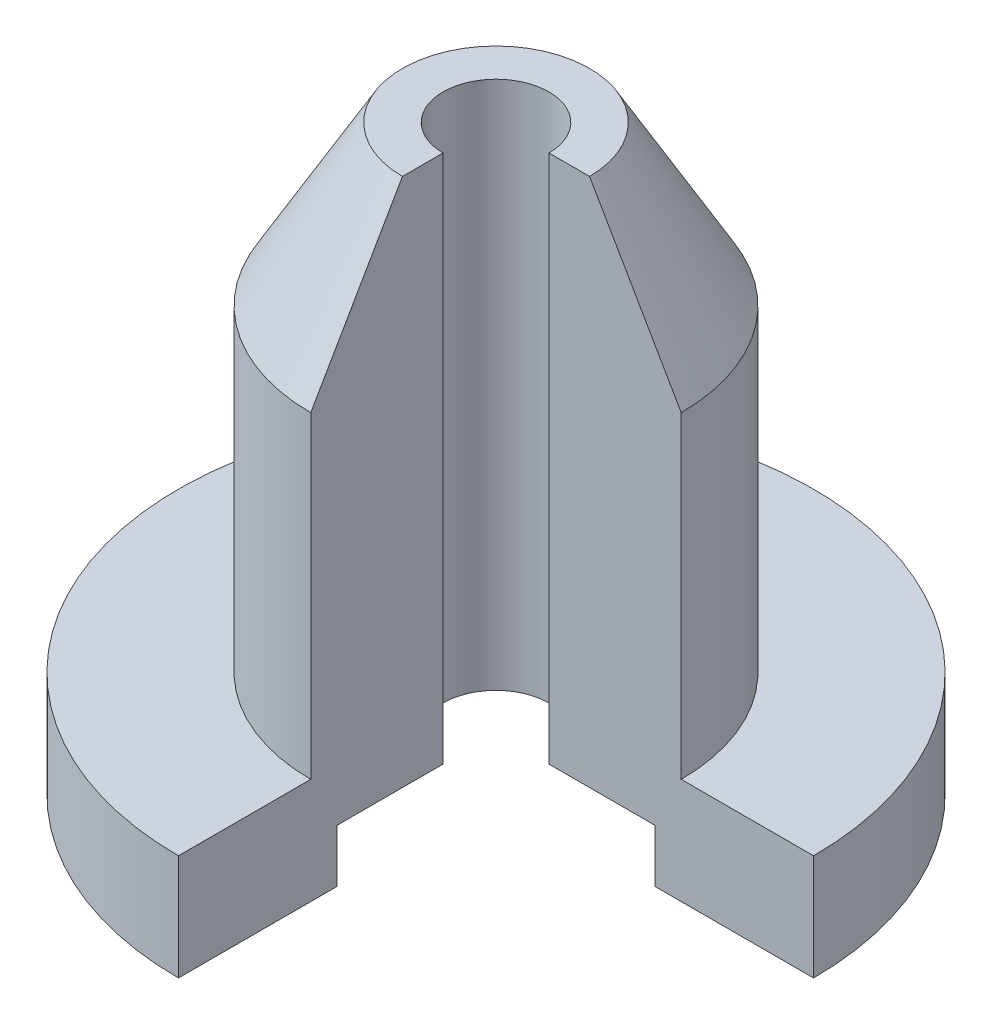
ISO-10303-21;
HEADER;
FILE_DESCRIPTION(('STEP AP214'),'2;1');
FILE_NAME('part.step','',(''),(''),'','','');
FILE_SCHEMA(('AUTOMOTIVE_DESIGN { 1 0 10303 214 1 1 1 1 }'));
ENDSEC;
DATA;
#1=APPLICATION_CONTEXT('core data for automotive mechanical design processes');
#2=APPLICATION_PROTOCOL_DEFINITION('international standard','automotive_design',2000,#1);
#3=PRODUCT_CONTEXT('',#1,'mechanical');
#4=PRODUCT('Part','Part','',(#3));
#5=PRODUCT_RELATED_PRODUCT_CATEGORY('part','',(#4));
#6=PRODUCT_DEFINITION_FORMATION('','',#4);
#7=PRODUCT_DEFINITION_CONTEXT('part definition',#1,'design');
#8=PRODUCT_DEFINITION('design','',#6,#7);
#9=PRODUCT_DEFINITION_SHAPE('','',#8);
#10=(LENGTH_UNIT() NAMED_UNIT(*) SI_UNIT(.MILLI.,.METRE.));
#11=(NAMED_UNIT(*) PLANE_ANGLE_UNIT() SI_UNIT($,.RADIAN.));
#12=(NAMED_UNIT(*) SI_UNIT($,.STERADIAN.) SOLID_ANGLE_UNIT());
#13=UNCERTAINTY_MEASURE_WITH_UNIT(LENGTH_MEASURE(1.E-05),#10,'distance_accuracy_value','');
#14=(GEOMETRIC_REPRESENTATION_CONTEXT(3) GLOBAL_UNCERTAINTY_ASSIGNED_CONTEXT((#13)) GLOBAL_UNIT_ASSIGNED_CONTEXT((#10,
#11,#12)) REPRESENTATION_CONTEXT('',''));
#15=CARTESIAN_POINT('',(0.,0.,0.));
#16=DIRECTION('',(0.,0.,1.));
#17=DIRECTION('',(1.,0.,0.));
#18=AXIS2_PLACEMENT_3D('',#15,#16,#17);
#19=CARTESIAN_POINT('',(3.14233320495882E-13,0.,30.));
#20=DIRECTION('',(0.,-1.,0.));
#21=DIRECTION('',(0.,0.,-1.));
#22=AXIS2_PLACEMENT_3D('',#19,#20,#21);
#23=PLANE('',#22);
#24=CARTESIAN_POINT('',(0.,0.,0.));
#25=DIRECTION('',(0.,-1.,0.));
#26=DIRECTION('',(0.,0.,-1.));
#27=AXIS2_PLACEMENT_3D('',#24,#25,#26);
#28=CIRCLE('',#27,15.);
#29=CARTESIAN_POINT('',(1.57116660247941E-13,0.,15.));
#30=VERTEX_POINT('',#29);
#31=CARTESIAN_POINT('',(15.,0.,0.));
#32=VERTEX_POINT('',#31);
#33=EDGE_CURVE('E11',#30,#32,#28,.T.);
#34=ORIENTED_EDGE('',*,*,#33,.F.);
#35=DIRECTION('',(0.,0.,1.));
#36=VECTOR('',#35,1.);
#37=CARTESIAN_POINT('',(3.14233320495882E-13,0.,30.));
#38=LINE('',#37,#36);
#39=CARTESIAN_POINT('',(3.14233320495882E-13,0.,30.));
#40=VERTEX_POINT('',#39);
#41=EDGE_CURVE('E105',#30,#40,#38,.T.);
#42=ORIENTED_EDGE('',*,*,#41,.T.);
#43=CARTESIAN_POINT('',(0.,0.,0.));
#44=DIRECTION('',(0.,-1.,0.));
#45=DIRECTION('',(0.,0.,-1.));
#46=AXIS2_PLACEMENT_3D('',#43,#44,#45);
#47=CIRCLE('',#46,30.);
#48=CARTESIAN_POINT('',(30.,0.,0.));
#49=VERTEX_POINT('',#48);
#50=EDGE_CURVE('E100',#40,#49,#47,.T.);
#51=ORIENTED_EDGE('',*,*,#50,.T.);
#52=DIRECTION('',(1.,0.,0.));
#53=VECTOR('',#52,1.);
#54=CARTESIAN_POINT('',(30.,0.,0.));
#55=LINE('',#54,#53);
#56=EDGE_CURVE('E103',#32,#49,#55,.T.);
#57=ORIENTED_EDGE('',*,*,#56,.F.);
#58=EDGE_LOOP('',(#34,#42,#51,#57));
#59=FACE_BOUND('',#58,.T.);
#60=ADVANCED_FACE('F34',(#59),#23,.T.);
#61=CARTESIAN_POINT('',(0.,0.,0.));
#62=DIRECTION('',(0.,-1.,0.));
#63=DIRECTION('',(0.,0.,-1.));
#64=AXIS2_PLACEMENT_3D('',#61,#62,#63);
#65=CYLINDRICAL_SURFACE('',#64,15.);
#66=CARTESIAN_POINT('',(0.,5.,0.));
#67=DIRECTION('',(0.,-1.,0.));
#68=DIRECTION('',(0.,0.,-1.));
#69=AXIS2_PLACEMENT_3D('',#66,#67,#68);
#70=CIRCLE('',#69,15.);
#71=CARTESIAN_POINT('',(1.57116660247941E-13,5.,15.));
#72=VERTEX_POINT('',#71);
#73=CARTESIAN_POINT('',(15.,5.,0.));
#74=VERTEX_POINT('',#73);
#75=EDGE_CURVE('E42',#72,#74,#70,.T.);
#76=ORIENTED_EDGE('',*,*,#75,.F.);
#77=DIRECTION('',(0.,-1.,0.));
#78=VECTOR('',#77,1.);
#79=CARTESIAN_POINT('',(1.57116660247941E-13,0.,15.));
#80=LINE('',#79,#78);
#81=EDGE_CURVE('E110',#72,#30,#80,.T.);
#82=ORIENTED_EDGE('',*,*,#81,.T.);
#83=ORIENTED_EDGE('',*,*,#33,.T.);
#84=DIRECTION('',(0.,-1.,0.));
#85=VECTOR('',#84,1.);
#86=CARTESIAN_POINT('',(15.,0.,0.));
#87=LINE('',#86,#85);
#88=EDGE_CURVE('E123',#74,#32,#87,.T.);
#89=ORIENTED_EDGE('',*,*,#88,.F.);
#90=EDGE_LOOP('',(#76,#82,#83,#89));
#91=FACE_BOUND('',#90,.T.);
#92=ADVANCED_FACE('F36',(#91),#65,.F.);
#93=CARTESIAN_POINT('',(1.57116660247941E-13,5.,15.));
#94=DIRECTION('',(0.,-1.,0.));
#95=DIRECTION('',(0.,0.,-1.));
#96=AXIS2_PLACEMENT_3D('',#93,#94,#95);
#97=PLANE('',#96);
#98=CARTESIAN_POINT('',(0.,5.,0.));
#99=DIRECTION('',(0.,-1.,0.));
#100=DIRECTION('',(0.,0.,-1.));
#101=AXIS2_PLACEMENT_3D('',#98,#99,#100);
#102=CIRCLE('',#101,5.);
#103=CARTESIAN_POINT('',(0.,5.,5.));
#104=VERTEX_POINT('',#103);
#105=CARTESIAN_POINT('',(5.,5.,0.));
#106=VERTEX_POINT('',#105);
#107=EDGE_CURVE('E172',#104,#106,#102,.T.);
#108=ORIENTED_EDGE('',*,*,#107,.F.);
#109=DIRECTION('',(0.,0.,1.));
#110=VECTOR('',#109,1.);
#111=CARTESIAN_POINT('',(1.57116660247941E-13,5.,15.));
#112=LINE('',#111,#110);
#113=EDGE_CURVE('E160',#104,#72,#112,.T.);
#114=ORIENTED_EDGE('',*,*,#113,.T.);
#115=ORIENTED_EDGE('',*,*,#75,.T.);
#116=DIRECTION('',(1.,0.,0.));
#117=VECTOR('',#116,1.);
#118=CARTESIAN_POINT('',(15.,5.,0.));
#119=LINE('',#118,#117);
#120=EDGE_CURVE('E139',#106,#74,#119,.T.);
#121=ORIENTED_EDGE('',*,*,#120,.F.);
#122=EDGE_LOOP('',(#108,#114,#115,#121));
#123=FACE_BOUND('',#122,.T.);
#124=ADVANCED_FACE('F175',(#123),#97,.T.);
#125=CARTESIAN_POINT('',(0.,0.,0.));
#126=DIRECTION('',(0.,-1.,0.));
#127=DIRECTION('',(0.,0.,-1.));
#128=AXIS2_PLACEMENT_3D('',#125,#126,#127);
#129=CYLINDRICAL_SURFACE('',#128,5.);
#130=CARTESIAN_POINT('',(0.,55.,0.));
#131=DIRECTION('',(0.,-1.,0.));
#132=DIRECTION('',(0.,0.,-1.));
#133=AXIS2_PLACEMENT_3D('',#130,#131,#132);
#134=CIRCLE('',#133,5.);
#135=CARTESIAN_POINT('',(0.,55.,5.));
#136=VERTEX_POINT('',#135);
#137=CARTESIAN_POINT('',(5.,55.,0.));
#138=VERTEX_POINT('',#137);
#139=EDGE_CURVE('E170',#136,#138,#134,.T.);
#140=ORIENTED_EDGE('',*,*,#139,.F.);
#141=DIRECTION('',(0.,-1.,0.));
#142=VECTOR('',#141,1.);
#143=CARTESIAN_POINT('',(0.,5.,5.));
#144=LINE('',#143,#142);
#145=EDGE_CURVE('E157',#136,#104,#144,.T.);
#146=ORIENTED_EDGE('',*,*,#145,.T.);
#147=ORIENTED_EDGE('',*,*,#107,.T.);
#148=DIRECTION('',(0.,-1.,0.));
#149=VECTOR('',#148,1.);
#150=CARTESIAN_POINT('',(5.,5.,0.));
#151=LINE('',#150,#149);
#152=EDGE_CURVE('E136',#138,#106,#151,.T.);
#153=ORIENTED_EDGE('',*,*,#152,.F.);
#154=EDGE_LOOP('',(#140,#146,#147,#153));
#155=FACE_BOUND('',#154,.T.);
#156=ADVANCED_FACE('F198',(#155),#129,.F.);
#157=CARTESIAN_POINT('',(0.,55.,5.));
#158=DIRECTION('',(0.,1.,0.));
#159=DIRECTION('',(0.,0.,1.));
#160=AXIS2_PLACEMENT_3D('',#157,#158,#159);
#161=PLANE('',#160);
#162=CARTESIAN_POINT('',(0.,55.,0.));
#163=DIRECTION('',(0.,-1.,0.));
#164=DIRECTION('',(0.,0.,-1.));
#165=AXIS2_PLACEMENT_3D('',#162,#163,#164);
#166=CIRCLE('',#165,8.83974596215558);
#167=CARTESIAN_POINT('',(0.,55.,8.83974596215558));
#168=VERTEX_POINT('',#167);
#169=CARTESIAN_POINT('',(8.83974596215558,55.,0.));
#170=VERTEX_POINT('',#169);
#171=EDGE_CURVE('E168',#168,#170,#166,.T.);
#172=ORIENTED_EDGE('',*,*,#171,.F.);
#173=DIRECTION('',(0.,0.,-1.));
#174=VECTOR('',#173,1.);
#175=CARTESIAN_POINT('',(0.,55.,5.));
#176=LINE('',#175,#174);
#177=EDGE_CURVE('E154',#168,#136,#176,.T.);
#178=ORIENTED_EDGE('',*,*,#177,.T.);
#179=ORIENTED_EDGE('',*,*,#139,.T.);
#180=DIRECTION('',(-1.,0.,0.));
#181=VECTOR('',#180,1.);
#182=CARTESIAN_POINT('',(5.,55.,0.));
#183=LINE('',#182,#181);
#184=EDGE_CURVE('E133',#170,#138,#183,.T.);
#185=ORIENTED_EDGE('',*,*,#184,.F.);
#186=EDGE_LOOP('',(#172,#178,#179,#185));
#187=FACE_BOUND('',#186,.T.);
#188=ADVANCED_FACE('F195',(#187),#161,.T.);
#189=CARTESIAN_POINT('',(0.,40.,0.));
#190=DIRECTION('',(0.,-1.,0.));
#191=DIRECTION('',(0.,0.,-1.));
#192=AXIS2_PLACEMENT_3D('',#189,#190,#191);
#193=CONICAL_SURFACE('',#192,17.5,0.5235987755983);
#194=CARTESIAN_POINT('',(0.,40.,0.));
#195=DIRECTION('',(0.,-1.,0.));
#196=DIRECTION('',(0.,0.,-1.));
#197=AXIS2_PLACEMENT_3D('',#194,#195,#196);
#198=CIRCLE('',#197,17.5);
#199=CARTESIAN_POINT('',(1.83302770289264E-13,40.,17.5));
#200=VERTEX_POINT('',#199);
#201=CARTESIAN_POINT('',(17.5,40.,0.));
#202=VERTEX_POINT('',#201);
#203=EDGE_CURVE('E166',#200,#202,#198,.T.);
#204=ORIENTED_EDGE('',*,*,#203,.F.);
#205=DIRECTION('',(0.,0.866025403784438,-0.500000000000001));
#206=VECTOR('',#205,1.);
#207=CARTESIAN_POINT('',(0.,55.,8.83974596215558));
#208=LINE('',#207,#206);
#209=EDGE_CURVE('E151',#200,#168,#208,.T.);
#210=ORIENTED_EDGE('',*,*,#209,.T.);
#211=ORIENTED_EDGE('',*,*,#171,.T.);
#212=DIRECTION('',(-0.500000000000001,0.866025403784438,0.));
#213=VECTOR('',#212,1.);
#214=CARTESIAN_POINT('',(8.83974596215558,55.,0.));
#215=LINE('',#214,#213);
#216=EDGE_CURVE('E130',#202,#170,#215,.T.);
#217=ORIENTED_EDGE('',*,*,#216,.F.);
#218=EDGE_LOOP('',(#204,#210,#211,#217));
#219=FACE_BOUND('',#218,.T.);
#220=ADVANCED_FACE('F191',(#219),#193,.T.);
#221=CARTESIAN_POINT('',(0.,0.,0.));
#222=DIRECTION('',(0.,-1.,0.));
#223=DIRECTION('',(0.,0.,-1.));
#224=AXIS2_PLACEMENT_3D('',#221,#222,#223);
#225=CYLINDRICAL_SURFACE('',#224,17.5);
#226=CARTESIAN_POINT('',(0.,10.,0.));
#227=DIRECTION('',(0.,-1.,0.));
#228=DIRECTION('',(0.,0.,-1.));
#229=AXIS2_PLACEMENT_3D('',#226,#227,#228);
#230=CIRCLE('',#229,17.5);
#231=CARTESIAN_POINT('',(1.83302770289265E-13,10.,17.5));
#232=VERTEX_POINT('',#231);
#233=CARTESIAN_POINT('',(17.5,10.,0.));
#234=VERTEX_POINT('',#233);
#235=EDGE_CURVE('E164',#232,#234,#230,.T.);
#236=ORIENTED_EDGE('',*,*,#235,.F.);
#237=DIRECTION('',(0.,1.,0.));
#238=VECTOR('',#237,1.);
#239=CARTESIAN_POINT('',(1.83302770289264E-13,40.,17.5));
#240=LINE('',#239,#238);
#241=EDGE_CURVE('E148',#232,#200,#240,.T.);
#242=ORIENTED_EDGE('',*,*,#241,.T.);
#243=ORIENTED_EDGE('',*,*,#203,.T.);
#244=DIRECTION('',(0.,1.,0.));
#245=VECTOR('',#244,1.);
#246=CARTESIAN_POINT('',(17.5,40.,0.));
#247=LINE('',#246,#245);
#248=EDGE_CURVE('E127',#234,#202,#247,.T.);
#249=ORIENTED_EDGE('',*,*,#248,.F.);
#250=EDGE_LOOP('',(#236,#242,#243,#249));
#251=FACE_BOUND('',#250,.T.);
#252=ADVANCED_FACE('F189',(#251),#225,.T.);
#253=CARTESIAN_POINT('',(1.83302770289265E-13,10.,17.5));
#254=DIRECTION('',(0.,1.,0.));
#255=DIRECTION('',(0.,0.,1.));
#256=AXIS2_PLACEMENT_3D('',#253,#254,#255);
#257=PLANE('',#256);
#258=CARTESIAN_POINT('',(0.,10.,0.));
#259=DIRECTION('',(0.,-1.,0.));
#260=DIRECTION('',(0.,0.,-1.));
#261=AXIS2_PLACEMENT_3D('',#258,#259,#260);
#262=CIRCLE('',#261,30.);
#263=CARTESIAN_POINT('',(3.14233320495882E-13,10.,30.));
#264=VERTEX_POINT('',#263);
#265=CARTESIAN_POINT('',(30.,10.,0.));
#266=VERTEX_POINT('',#265);
#267=EDGE_CURVE('E109',#264,#266,#262,.T.);
#268=ORIENTED_EDGE('',*,*,#267,.F.);
#269=DIRECTION('',(0.,0.,-1.));
#270=VECTOR('',#269,1.);
#271=CARTESIAN_POINT('',(1.83302770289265E-13,10.,17.5));
#272=LINE('',#271,#270);
#273=EDGE_CURVE('E145',#264,#232,#272,.T.);
#274=ORIENTED_EDGE('',*,*,#273,.T.);
#275=ORIENTED_EDGE('',*,*,#235,.T.);
#276=DIRECTION('',(-1.,0.,0.));
#277=VECTOR('',#276,1.);
#278=CARTESIAN_POINT('',(17.5,10.,0.));
#279=LINE('',#278,#277);
#280=EDGE_CURVE('E118',#266,#234,#279,.T.);
#281=ORIENTED_EDGE('',*,*,#280,.F.);
#282=EDGE_LOOP('',(#268,#274,#275,#281));
#283=FACE_BOUND('',#282,.T.);
#284=ADVANCED_FACE('F185',(#283),#257,.T.);
#285=CARTESIAN_POINT('',(0.,0.,0.));
#286=DIRECTION('',(0.,-1.,0.));
#287=DIRECTION('',(0.,0.,-1.));
#288=AXIS2_PLACEMENT_3D('',#285,#286,#287);
#289=CYLINDRICAL_SURFACE('',#288,30.);
#290=DIRECTION('',(0.,1.,0.));
#291=VECTOR('',#290,1.);
#292=CARTESIAN_POINT('',(3.14233320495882E-13,10.,30.));
#293=LINE('',#292,#291);
#294=EDGE_CURVE('E143',#40,#264,#293,.T.);
#295=ORIENTED_EDGE('',*,*,#294,.T.);
#296=ORIENTED_EDGE('',*,*,#267,.T.);
#297=DIRECTION('',(0.,1.,0.));
#298=VECTOR('',#297,1.);
#299=CARTESIAN_POINT('',(30.,10.,0.));
#300=LINE('',#299,#298);
#301=EDGE_CURVE('E113',#49,#266,#300,.T.);
#302=ORIENTED_EDGE('',*,*,#301,.F.);
#303=ORIENTED_EDGE('',*,*,#50,.F.);
#304=EDGE_LOOP('',(#295,#296,#302,#303));
#305=FACE_BOUND('',#304,.T.);
#306=ADVANCED_FACE('F114',(#305),#289,.T.);
#307=CARTESIAN_POINT('',(0.,0.,0.));
#308=DIRECTION('',(1.,0.,0.));
#309=DIRECTION('',(0.,0.,-1.));
#310=AXIS2_PLACEMENT_3D('',#307,#308,#309);
#311=PLANE('',#310);
#312=ORIENTED_EDGE('',*,*,#41,.F.);
#313=ORIENTED_EDGE('',*,*,#81,.F.);
#314=ORIENTED_EDGE('',*,*,#113,.F.);
#315=ORIENTED_EDGE('',*,*,#145,.F.);
#316=ORIENTED_EDGE('',*,*,#177,.F.);
#317=ORIENTED_EDGE('',*,*,#209,.F.);
#318=ORIENTED_EDGE('',*,*,#241,.F.);
#319=ORIENTED_EDGE('',*,*,#273,.F.);
#320=ORIENTED_EDGE('',*,*,#294,.F.);
#321=EDGE_LOOP('',(#312,#313,#314,#315,#316,#317,#318,#319,#320));
#322=FACE_BOUND('',#321,.T.);
#323=ADVANCED_FACE('F180',(#322),#311,.T.);
#324=CARTESIAN_POINT('',(0.,0.,0.));
#325=DIRECTION('',(0.,0.,-1.));
#326=DIRECTION('',(-1.,0.,0.));
#327=AXIS2_PLACEMENT_3D('',#324,#325,#326);
#328=PLANE('',#327);
#329=ORIENTED_EDGE('',*,*,#56,.T.);
#330=ORIENTED_EDGE('',*,*,#301,.T.);
#331=ORIENTED_EDGE('',*,*,#280,.T.);
#332=ORIENTED_EDGE('',*,*,#248,.T.);
#333=ORIENTED_EDGE('',*,*,#216,.T.);
#334=ORIENTED_EDGE('',*,*,#184,.T.);
#335=ORIENTED_EDGE('',*,*,#152,.T.);
#336=ORIENTED_EDGE('',*,*,#120,.T.);
#337=ORIENTED_EDGE('',*,*,#88,.T.);
#338=EDGE_LOOP('',(#329,#330,#331,#332,#333,#334,#335,#336,#337));
#339=FACE_BOUND('',#338,.T.);
#340=ADVANCED_FACE('F121',(#339),#328,.F.);
#341=CLOSED_SHELL('',(#60,#92,#124,#156,#188,#220,#252,#284,#306,#323,#340));
#342=MANIFOLD_SOLID_BREP('B2',#341);
#343=ADVANCED_BREP_SHAPE_REPRESENTATION('',(#18,#342),#14);
#344=SHAPE_DEFINITION_REPRESENTATION(#9,#343);
ENDSEC;
END-ISO-10303-21;
